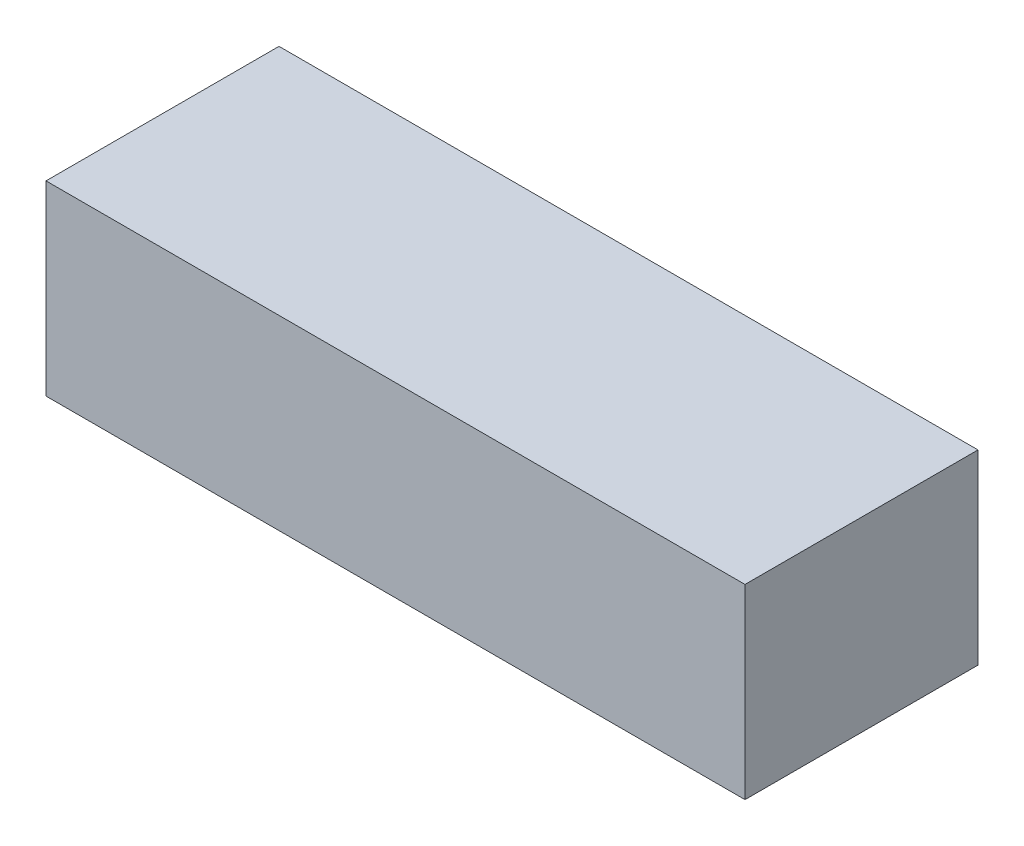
from build123d import *

# Parameters (mm, degrees)
SKETCH1_W           = 38.1
SKETCH1_H           = 12.7
BOSS_EXTRUDE1_DEPTH = 10.16


with BuildPart() as part:
    # Sketch1 → Boss-Extrude1 (new body)
    with BuildSketch(Plane(origin=(0, 0, 0), x_dir=(1, 0, 0), z_dir=(0, 1, 0))):
        Rectangle(SKETCH1_W, SKETCH1_H)
    extrude(amount=BOSS_EXTRUDE1_DEPTH)


solid = part.part
